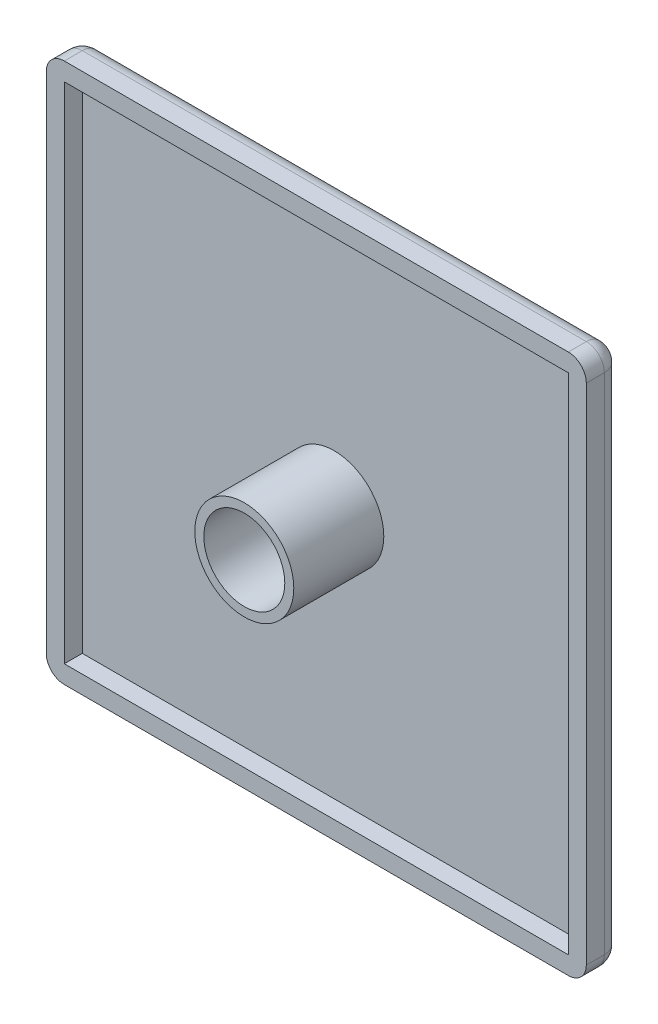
ISO-10303-21;
HEADER;
FILE_DESCRIPTION(('STEP AP214'),'2;1');
FILE_NAME('part.step','',(''),(''),'','','');
FILE_SCHEMA(('AUTOMOTIVE_DESIGN { 1 0 10303 214 1 1 1 1 }'));
ENDSEC;
DATA;
#1=APPLICATION_CONTEXT('core data for automotive mechanical design processes');
#2=APPLICATION_PROTOCOL_DEFINITION('international standard','automotive_design',2000,#1);
#3=PRODUCT_CONTEXT('',#1,'mechanical');
#4=PRODUCT('Part','Part','',(#3));
#5=PRODUCT_RELATED_PRODUCT_CATEGORY('part','',(#4));
#6=PRODUCT_DEFINITION_FORMATION('','',#4);
#7=PRODUCT_DEFINITION_CONTEXT('part definition',#1,'design');
#8=PRODUCT_DEFINITION('design','',#6,#7);
#9=PRODUCT_DEFINITION_SHAPE('','',#8);
#10=(LENGTH_UNIT() NAMED_UNIT(*) SI_UNIT(.MILLI.,.METRE.));
#11=(NAMED_UNIT(*) PLANE_ANGLE_UNIT() SI_UNIT($,.RADIAN.));
#12=(NAMED_UNIT(*) SI_UNIT($,.STERADIAN.) SOLID_ANGLE_UNIT());
#13=UNCERTAINTY_MEASURE_WITH_UNIT(LENGTH_MEASURE(1.E-05),#10,'distance_accuracy_value','');
#14=(GEOMETRIC_REPRESENTATION_CONTEXT(3) GLOBAL_UNCERTAINTY_ASSIGNED_CONTEXT((#13)) GLOBAL_UNIT_ASSIGNED_CONTEXT((#10,
#11,#12)) REPRESENTATION_CONTEXT('',''));
#15=CARTESIAN_POINT('',(0.,0.,0.));
#16=DIRECTION('',(0.,0.,1.));
#17=DIRECTION('',(1.,0.,0.));
#18=AXIS2_PLACEMENT_3D('',#15,#16,#17);
#19=CARTESIAN_POINT('',(0.,0.,0.));
#20=DIRECTION('',(0.,0.,1.));
#21=DIRECTION('',(1.,0.,0.));
#22=AXIS2_PLACEMENT_3D('',#19,#20,#21);
#23=PLANE('',#22);
#24=DIRECTION('',(0.,-1.,0.));
#25=VECTOR('',#24,1.);
#26=CARTESIAN_POINT('',(-28.,30.,0.));
#27=LINE('',#26,#25);
#28=CARTESIAN_POINT('',(-28.,28.,0.));
#29=VERTEX_POINT('',#28);
#30=CARTESIAN_POINT('',(-28.,-28.,0.));
#31=VERTEX_POINT('',#30);
#32=EDGE_CURVE('E140',#29,#31,#27,.T.);
#33=ORIENTED_EDGE('',*,*,#32,.T.);
#34=DIRECTION('',(1.,0.,0.));
#35=VECTOR('',#34,1.);
#36=CARTESIAN_POINT('',(-30.,-28.,0.));
#37=LINE('',#36,#35);
#38=CARTESIAN_POINT('',(28.,-28.,0.));
#39=VERTEX_POINT('',#38);
#40=EDGE_CURVE('E133',#31,#39,#37,.T.);
#41=ORIENTED_EDGE('',*,*,#40,.T.);
#42=DIRECTION('',(0.,1.,0.));
#43=VECTOR('',#42,1.);
#44=CARTESIAN_POINT('',(28.,30.,0.));
#45=LINE('',#44,#43);
#46=CARTESIAN_POINT('',(28.,28.,0.));
#47=VERTEX_POINT('',#46);
#48=EDGE_CURVE('E137',#39,#47,#45,.T.);
#49=ORIENTED_EDGE('',*,*,#48,.T.);
#50=DIRECTION('',(-1.,0.,0.));
#51=VECTOR('',#50,1.);
#52=CARTESIAN_POINT('',(-30.,28.,0.));
#53=LINE('',#52,#51);
#54=EDGE_CURVE('E158',#47,#29,#53,.T.);
#55=ORIENTED_EDGE('',*,*,#54,.T.);
#56=EDGE_LOOP('',(#33,#41,#49,#55));
#57=FACE_BOUND('',#56,.T.);
#58=CARTESIAN_POINT('',(0.,0.,0.));
#59=DIRECTION('',(0.,0.,1.));
#60=DIRECTION('',(1.,0.,0.));
#61=AXIS2_PLACEMENT_3D('',#58,#59,#60);
#62=CIRCLE('',#61,5.5);
#63=CARTESIAN_POINT('',(5.5,0.,0.));
#64=VERTEX_POINT('',#63);
#65=EDGE_CURVE('E260',#64,#64,#62,.T.);
#66=ORIENTED_EDGE('',*,*,#65,.F.);
#67=EDGE_LOOP('',(#66));
#68=FACE_BOUND('',#67,.T.);
#69=ADVANCED_FACE('F33',(#57,#68),#23,.T.);
#70=CARTESIAN_POINT('',(-30.,30.,2.));
#71=DIRECTION('',(1.,0.,0.));
#72=DIRECTION('',(0.,1.,0.));
#73=AXIS2_PLACEMENT_3D('',#70,#71,#72);
#74=PLANE('',#73);
#75=DIRECTION('',(0.,-1.,0.));
#76=VECTOR('',#75,1.);
#77=CARTESIAN_POINT('',(-30.,30.,2.));
#78=LINE('',#77,#76);
#79=CARTESIAN_POINT('',(-30.,28.,2.));
#80=VERTEX_POINT('',#79);
#81=CARTESIAN_POINT('',(-30.,-28.,2.));
#82=VERTEX_POINT('',#81);
#83=EDGE_CURVE('E171',#80,#82,#78,.T.);
#84=ORIENTED_EDGE('',*,*,#83,.F.);
#85=DIRECTION('',(0.,0.,-1.));
#86=VECTOR('',#85,1.);
#87=CARTESIAN_POINT('',(-30.,28.,2.));
#88=LINE('',#87,#86);
#89=CARTESIAN_POINT('',(-30.,28.,0.));
#90=VERTEX_POINT('',#89);
#91=EDGE_CURVE('E187',#80,#90,#88,.T.);
#92=ORIENTED_EDGE('',*,*,#91,.T.);
#93=DIRECTION('',(0.,-1.,0.));
#94=VECTOR('',#93,1.);
#95=CARTESIAN_POINT('',(-30.,30.,0.));
#96=LINE('',#95,#94);
#97=CARTESIAN_POINT('',(-30.,-28.,0.));
#98=VERTEX_POINT('',#97);
#99=EDGE_CURVE('E183',#90,#98,#96,.T.);
#100=ORIENTED_EDGE('',*,*,#99,.T.);
#101=DIRECTION('',(0.,0.,-1.));
#102=VECTOR('',#101,1.);
#103=CARTESIAN_POINT('',(-30.,-28.,2.));
#104=LINE('',#103,#102);
#105=EDGE_CURVE('E185',#98,#82,#104,.F.);
#106=ORIENTED_EDGE('',*,*,#105,.T.);
#107=EDGE_LOOP('',(#84,#92,#100,#106));
#108=FACE_BOUND('',#107,.T.);
#109=ADVANCED_FACE('F290',(#108),#74,.F.);
#110=CARTESIAN_POINT('',(-30.,-30.,2.));
#111=DIRECTION('',(0.,1.,0.));
#112=DIRECTION('',(0.,0.,1.));
#113=AXIS2_PLACEMENT_3D('',#110,#111,#112);
#114=PLANE('',#113);
#115=DIRECTION('',(1.,0.,0.));
#116=VECTOR('',#115,1.);
#117=CARTESIAN_POINT('',(-30.,-30.,0.));
#118=LINE('',#117,#116);
#119=CARTESIAN_POINT('',(-28.,-30.,0.));
#120=VERTEX_POINT('',#119);
#121=CARTESIAN_POINT('',(28.,-30.,0.));
#122=VERTEX_POINT('',#121);
#123=EDGE_CURVE('E210',#120,#122,#118,.T.);
#124=ORIENTED_EDGE('',*,*,#123,.T.);
#125=DIRECTION('',(0.,0.,-1.));
#126=VECTOR('',#125,1.);
#127=CARTESIAN_POINT('',(28.,-30.,2.));
#128=LINE('',#127,#126);
#129=CARTESIAN_POINT('',(28.,-30.,2.));
#130=VERTEX_POINT('',#129);
#131=EDGE_CURVE('E214',#122,#130,#128,.F.);
#132=ORIENTED_EDGE('',*,*,#131,.T.);
#133=DIRECTION('',(1.,0.,0.));
#134=VECTOR('',#133,1.);
#135=CARTESIAN_POINT('',(-30.,-30.,2.));
#136=LINE('',#135,#134);
#137=CARTESIAN_POINT('',(-28.,-30.,2.));
#138=VERTEX_POINT('',#137);
#139=EDGE_CURVE('E174',#138,#130,#136,.T.);
#140=ORIENTED_EDGE('',*,*,#139,.F.);
#141=DIRECTION('',(0.,0.,-1.));
#142=VECTOR('',#141,1.);
#143=CARTESIAN_POINT('',(-28.,-30.,2.));
#144=LINE('',#143,#142);
#145=EDGE_CURVE('E212',#138,#120,#144,.T.);
#146=ORIENTED_EDGE('',*,*,#145,.T.);
#147=EDGE_LOOP('',(#124,#132,#140,#146));
#148=FACE_BOUND('',#147,.T.);
#149=ADVANCED_FACE('F301',(#148),#114,.F.);
#150=CARTESIAN_POINT('',(30.,30.,2.));
#151=DIRECTION('',(-1.,0.,0.));
#152=DIRECTION('',(0.,0.,1.));
#153=AXIS2_PLACEMENT_3D('',#150,#151,#152);
#154=PLANE('',#153);
#155=DIRECTION('',(0.,1.,0.));
#156=VECTOR('',#155,1.);
#157=CARTESIAN_POINT('',(30.,30.,2.));
#158=LINE('',#157,#156);
#159=CARTESIAN_POINT('',(30.,-28.,2.));
#160=VERTEX_POINT('',#159);
#161=CARTESIAN_POINT('',(30.,28.,2.));
#162=VERTEX_POINT('',#161);
#163=EDGE_CURVE('E177',#160,#162,#158,.T.);
#164=ORIENTED_EDGE('',*,*,#163,.F.);
#165=DIRECTION('',(0.,0.,-1.));
#166=VECTOR('',#165,1.);
#167=CARTESIAN_POINT('',(30.,-28.,2.));
#168=LINE('',#167,#166);
#169=CARTESIAN_POINT('',(30.,-28.,0.));
#170=VERTEX_POINT('',#169);
#171=EDGE_CURVE('E208',#160,#170,#168,.T.);
#172=ORIENTED_EDGE('',*,*,#171,.T.);
#173=DIRECTION('',(0.,1.,0.));
#174=VECTOR('',#173,1.);
#175=CARTESIAN_POINT('',(30.,30.,0.));
#176=LINE('',#175,#174);
#177=CARTESIAN_POINT('',(30.,28.,0.));
#178=VERTEX_POINT('',#177);
#179=EDGE_CURVE('E206',#170,#178,#176,.T.);
#180=ORIENTED_EDGE('',*,*,#179,.T.);
#181=DIRECTION('',(0.,0.,-1.));
#182=VECTOR('',#181,1.);
#183=CARTESIAN_POINT('',(30.,28.,2.));
#184=LINE('',#183,#182);
#185=EDGE_CURVE('E204',#178,#162,#184,.F.);
#186=ORIENTED_EDGE('',*,*,#185,.T.);
#187=EDGE_LOOP('',(#164,#172,#180,#186));
#188=FACE_BOUND('',#187,.T.);
#189=ADVANCED_FACE('F314',(#188),#154,.F.);
#190=CARTESIAN_POINT('',(-30.,30.,2.));
#191=DIRECTION('',(0.,-1.,0.));
#192=DIRECTION('',(1.,0.,0.));
#193=AXIS2_PLACEMENT_3D('',#190,#191,#192);
#194=PLANE('',#193);
#195=DIRECTION('',(-1.,0.,0.));
#196=VECTOR('',#195,1.);
#197=CARTESIAN_POINT('',(-30.,30.,0.));
#198=LINE('',#197,#196);
#199=CARTESIAN_POINT('',(28.,30.,0.));
#200=VERTEX_POINT('',#199);
#201=CARTESIAN_POINT('',(-28.,30.,0.));
#202=VERTEX_POINT('',#201);
#203=EDGE_CURVE('E192',#200,#202,#198,.T.);
#204=ORIENTED_EDGE('',*,*,#203,.T.);
#205=DIRECTION('',(0.,0.,-1.));
#206=VECTOR('',#205,1.);
#207=CARTESIAN_POINT('',(-28.,30.,2.));
#208=LINE('',#207,#206);
#209=CARTESIAN_POINT('',(-28.,30.,2.));
#210=VERTEX_POINT('',#209);
#211=EDGE_CURVE('E194',#202,#210,#208,.F.);
#212=ORIENTED_EDGE('',*,*,#211,.T.);
#213=DIRECTION('',(-1.,0.,0.));
#214=VECTOR('',#213,1.);
#215=CARTESIAN_POINT('',(-30.,30.,2.));
#216=LINE('',#215,#214);
#217=CARTESIAN_POINT('',(28.,30.,2.));
#218=VERTEX_POINT('',#217);
#219=EDGE_CURVE('E180',#218,#210,#216,.T.);
#220=ORIENTED_EDGE('',*,*,#219,.F.);
#221=DIRECTION('',(0.,0.,-1.));
#222=VECTOR('',#221,1.);
#223=CARTESIAN_POINT('',(28.,30.,2.));
#224=LINE('',#223,#222);
#225=EDGE_CURVE('E190',#218,#200,#224,.T.);
#226=ORIENTED_EDGE('',*,*,#225,.T.);
#227=EDGE_LOOP('',(#204,#212,#220,#226));
#228=FACE_BOUND('',#227,.T.);
#229=ADVANCED_FACE('F276',(#228),#194,.F.);
#230=CARTESIAN_POINT('',(0.,0.,2.));
#231=DIRECTION('',(0.,0.,1.));
#232=DIRECTION('',(1.,0.,0.));
#233=AXIS2_PLACEMENT_3D('',#230,#231,#232);
#234=PLANE('',#233);
#235=DIRECTION('',(0.,-1.,0.));
#236=VECTOR('',#235,1.);
#237=CARTESIAN_POINT('',(-28.,30.,2.));
#238=LINE('',#237,#236);
#239=CARTESIAN_POINT('',(-28.,28.,2.));
#240=VERTEX_POINT('',#239);
#241=CARTESIAN_POINT('',(-28.,-28.,2.));
#242=VERTEX_POINT('',#241);
#243=EDGE_CURVE('E160',#240,#242,#238,.T.);
#244=ORIENTED_EDGE('',*,*,#243,.F.);
#245=DIRECTION('',(-1.,0.,0.));
#246=VECTOR('',#245,1.);
#247=CARTESIAN_POINT('',(-30.,28.,2.));
#248=LINE('',#247,#246);
#249=CARTESIAN_POINT('',(28.,28.,2.));
#250=VERTEX_POINT('',#249);
#251=EDGE_CURVE('E169',#250,#240,#248,.T.);
#252=ORIENTED_EDGE('',*,*,#251,.F.);
#253=DIRECTION('',(0.,1.,0.));
#254=VECTOR('',#253,1.);
#255=CARTESIAN_POINT('',(28.,30.,2.));
#256=LINE('',#255,#254);
#257=CARTESIAN_POINT('',(28.,-28.,2.));
#258=VERTEX_POINT('',#257);
#259=EDGE_CURVE('E167',#258,#250,#256,.T.);
#260=ORIENTED_EDGE('',*,*,#259,.F.);
#261=DIRECTION('',(1.,0.,0.));
#262=VECTOR('',#261,1.);
#263=CARTESIAN_POINT('',(-30.,-28.,2.));
#264=LINE('',#263,#262);
#265=EDGE_CURVE('E149',#242,#258,#264,.T.);
#266=ORIENTED_EDGE('',*,*,#265,.F.);
#267=EDGE_LOOP('',(#244,#252,#260,#266));
#268=FACE_BOUND('',#267,.T.);
#269=ORIENTED_EDGE('',*,*,#219,.T.);
#270=CARTESIAN_POINT('',(-28.,28.,2.));
#271=DIRECTION('',(0.,0.,1.));
#272=DIRECTION('',(1.,0.,0.));
#273=AXIS2_PLACEMENT_3D('',#270,#271,#272);
#274=CIRCLE('',#273,2.);
#275=EDGE_CURVE('E202',#210,#80,#274,.T.);
#276=ORIENTED_EDGE('',*,*,#275,.T.);
#277=ORIENTED_EDGE('',*,*,#83,.T.);
#278=CARTESIAN_POINT('',(-28.,-28.,2.));
#279=DIRECTION('',(0.,0.,1.));
#280=DIRECTION('',(1.,0.,0.));
#281=AXIS2_PLACEMENT_3D('',#278,#279,#280);
#282=CIRCLE('',#281,2.);
#283=EDGE_CURVE('E198',#82,#138,#282,.T.);
#284=ORIENTED_EDGE('',*,*,#283,.T.);
#285=ORIENTED_EDGE('',*,*,#139,.T.);
#286=CARTESIAN_POINT('',(28.,-28.,2.));
#287=DIRECTION('',(0.,0.,1.));
#288=DIRECTION('',(1.,0.,0.));
#289=AXIS2_PLACEMENT_3D('',#286,#287,#288);
#290=CIRCLE('',#289,2.);
#291=EDGE_CURVE('E200',#130,#160,#290,.T.);
#292=ORIENTED_EDGE('',*,*,#291,.T.);
#293=ORIENTED_EDGE('',*,*,#163,.T.);
#294=CARTESIAN_POINT('',(28.,28.,2.));
#295=DIRECTION('',(0.,0.,1.));
#296=DIRECTION('',(1.,0.,0.));
#297=AXIS2_PLACEMENT_3D('',#294,#295,#296);
#298=CIRCLE('',#297,2.);
#299=EDGE_CURVE('E196',#162,#218,#298,.T.);
#300=ORIENTED_EDGE('',*,*,#299,.T.);
#301=EDGE_LOOP('',(#269,#276,#277,#284,#285,#292,#293,#300));
#302=FACE_BOUND('',#301,.T.);
#303=ADVANCED_FACE('F272',(#268,#302),#234,.T.);
#304=CARTESIAN_POINT('',(0.,0.,-2.));
#305=DIRECTION('',(0.,0.,1.));
#306=DIRECTION('',(1.,0.,0.));
#307=AXIS2_PLACEMENT_3D('',#304,#305,#306);
#308=PLANE('',#307);
#309=DIRECTION('',(1.,0.,0.));
#310=VECTOR('',#309,1.);
#311=CARTESIAN_POINT('',(0.,-28.,-2.));
#312=LINE('',#311,#310);
#313=CARTESIAN_POINT('',(28.,-28.,-2.));
#314=VERTEX_POINT('',#313);
#315=CARTESIAN_POINT('',(-28.,-28.,-2.));
#316=VERTEX_POINT('',#315);
#317=EDGE_CURVE('E48',#314,#316,#312,.F.);
#318=ORIENTED_EDGE('',*,*,#317,.T.);
#319=DIRECTION('',(0.,-1.,0.));
#320=VECTOR('',#319,1.);
#321=CARTESIAN_POINT('',(-28.,0.,-2.));
#322=LINE('',#321,#320);
#323=CARTESIAN_POINT('',(-28.,28.,-2.));
#324=VERTEX_POINT('',#323);
#325=EDGE_CURVE('E41',#316,#324,#322,.F.);
#326=ORIENTED_EDGE('',*,*,#325,.T.);
#327=DIRECTION('',(-1.,0.,0.));
#328=VECTOR('',#327,1.);
#329=CARTESIAN_POINT('',(0.,28.,-2.));
#330=LINE('',#329,#328);
#331=CARTESIAN_POINT('',(28.,28.,-2.));
#332=VERTEX_POINT('',#331);
#333=EDGE_CURVE('E216',#324,#332,#330,.F.);
#334=ORIENTED_EDGE('',*,*,#333,.T.);
#335=DIRECTION('',(0.,1.,0.));
#336=VECTOR('',#335,1.);
#337=CARTESIAN_POINT('',(28.,0.,-2.));
#338=LINE('',#337,#336);
#339=EDGE_CURVE('E53',#332,#314,#338,.F.);
#340=ORIENTED_EDGE('',*,*,#339,.T.);
#341=EDGE_LOOP('',(#318,#326,#334,#340));
#342=FACE_BOUND('',#341,.T.);
#343=ADVANCED_FACE('F275',(#342),#308,.F.);
#344=CARTESIAN_POINT('',(-28.,30.,2.));
#345=DIRECTION('',(1.,0.,0.));
#346=DIRECTION('',(0.,1.,0.));
#347=AXIS2_PLACEMENT_3D('',#344,#345,#346);
#348=PLANE('',#347);
#349=ORIENTED_EDGE('',*,*,#32,.F.);
#350=DIRECTION('',(0.,0.,-1.));
#351=VECTOR('',#350,1.);
#352=CARTESIAN_POINT('',(-28.,28.,2.));
#353=LINE('',#352,#351);
#354=EDGE_CURVE('E163',#240,#29,#353,.T.);
#355=ORIENTED_EDGE('',*,*,#354,.F.);
#356=ORIENTED_EDGE('',*,*,#243,.T.);
#357=DIRECTION('',(0.,0.,-1.));
#358=VECTOR('',#357,1.);
#359=CARTESIAN_POINT('',(-28.,-28.,2.));
#360=LINE('',#359,#358);
#361=EDGE_CURVE('E153',#242,#31,#360,.T.);
#362=ORIENTED_EDGE('',*,*,#361,.T.);
#363=EDGE_LOOP('',(#349,#355,#356,#362));
#364=FACE_BOUND('',#363,.T.);
#365=ADVANCED_FACE('F270',(#364),#348,.T.);
#366=CARTESIAN_POINT('',(-30.,-28.,2.));
#367=DIRECTION('',(0.,1.,0.));
#368=DIRECTION('',(0.,0.,1.));
#369=AXIS2_PLACEMENT_3D('',#366,#367,#368);
#370=PLANE('',#369);
#371=ORIENTED_EDGE('',*,*,#40,.F.);
#372=ORIENTED_EDGE('',*,*,#361,.F.);
#373=ORIENTED_EDGE('',*,*,#265,.T.);
#374=DIRECTION('',(0.,0.,-1.));
#375=VECTOR('',#374,1.);
#376=CARTESIAN_POINT('',(28.,-28.,2.));
#377=LINE('',#376,#375);
#378=EDGE_CURVE('E146',#258,#39,#377,.T.);
#379=ORIENTED_EDGE('',*,*,#378,.T.);
#380=EDGE_LOOP('',(#371,#372,#373,#379));
#381=FACE_BOUND('',#380,.T.);
#382=ADVANCED_FACE('F147',(#381),#370,.T.);
#383=CARTESIAN_POINT('',(28.,30.,2.));
#384=DIRECTION('',(-1.,0.,0.));
#385=DIRECTION('',(0.,0.,1.));
#386=AXIS2_PLACEMENT_3D('',#383,#384,#385);
#387=PLANE('',#386);
#388=ORIENTED_EDGE('',*,*,#48,.F.);
#389=ORIENTED_EDGE('',*,*,#378,.F.);
#390=ORIENTED_EDGE('',*,*,#259,.T.);
#391=DIRECTION('',(0.,0.,-1.));
#392=VECTOR('',#391,1.);
#393=CARTESIAN_POINT('',(28.,28.,2.));
#394=LINE('',#393,#392);
#395=EDGE_CURVE('E154',#250,#47,#394,.T.);
#396=ORIENTED_EDGE('',*,*,#395,.T.);
#397=EDGE_LOOP('',(#388,#389,#390,#396));
#398=FACE_BOUND('',#397,.T.);
#399=ADVANCED_FACE('F156',(#398),#387,.T.);
#400=CARTESIAN_POINT('',(-30.,28.,2.));
#401=DIRECTION('',(0.,-1.,0.));
#402=DIRECTION('',(1.,0.,0.));
#403=AXIS2_PLACEMENT_3D('',#400,#401,#402);
#404=PLANE('',#403);
#405=ORIENTED_EDGE('',*,*,#54,.F.);
#406=ORIENTED_EDGE('',*,*,#395,.F.);
#407=ORIENTED_EDGE('',*,*,#251,.T.);
#408=ORIENTED_EDGE('',*,*,#354,.T.);
#409=EDGE_LOOP('',(#405,#406,#407,#408));
#410=FACE_BOUND('',#409,.T.);
#411=ADVANCED_FACE('F266',(#410),#404,.T.);
#412=CARTESIAN_POINT('',(28.,-28.,2.));
#413=DIRECTION('',(0.,0.,-1.));
#414=DIRECTION('',(-1.,0.,0.));
#415=AXIS2_PLACEMENT_3D('',#412,#413,#414);
#416=CYLINDRICAL_SURFACE('',#415,2.);
#417=CARTESIAN_POINT('',(28.,-28.,0.));
#418=DIRECTION('',(0.,0.,-1.));
#419=DIRECTION('',(-1.,0.,0.));
#420=AXIS2_PLACEMENT_3D('',#417,#418,#419);
#421=CIRCLE('',#420,2.);
#422=EDGE_CURVE('E251',#170,#122,#421,.T.);
#423=ORIENTED_EDGE('',*,*,#422,.F.);
#424=ORIENTED_EDGE('',*,*,#171,.F.);
#425=ORIENTED_EDGE('',*,*,#291,.F.);
#426=ORIENTED_EDGE('',*,*,#131,.F.);
#427=EDGE_LOOP('',(#423,#424,#425,#426));
#428=FACE_BOUND('',#427,.T.);
#429=ADVANCED_FACE('F35',(#428),#416,.T.);
#430=CARTESIAN_POINT('',(28.,-28.,0.));
#431=DIRECTION('',(0.,0.,1.));
#432=DIRECTION('',(1.,0.,0.));
#433=AXIS2_PLACEMENT_3D('',#430,#431,#432);
#434=SPHERICAL_SURFACE('',#433,2.);
#435=CARTESIAN_POINT('',(28.,-28.,0.));
#436=DIRECTION('',(0.,-1.,0.));
#437=DIRECTION('',(1.,0.,0.));
#438=AXIS2_PLACEMENT_3D('',#435,#436,#437);
#439=CIRCLE('',#438,2.);
#440=EDGE_CURVE('E247',#170,#314,#439,.F.);
#441=ORIENTED_EDGE('',*,*,#440,.F.);
#442=ORIENTED_EDGE('',*,*,#422,.T.);
#443=CARTESIAN_POINT('',(28.,-28.,0.));
#444=DIRECTION('',(1.,0.,0.));
#445=DIRECTION('',(0.,0.,-1.));
#446=AXIS2_PLACEMENT_3D('',#443,#444,#445);
#447=CIRCLE('',#446,2.);
#448=EDGE_CURVE('E249',#314,#122,#447,.F.);
#449=ORIENTED_EDGE('',*,*,#448,.F.);
#450=EDGE_LOOP('',(#441,#442,#449));
#451=FACE_BOUND('',#450,.T.);
#452=ADVANCED_FACE('F306',(#451),#434,.T.);
#453=CARTESIAN_POINT('',(-28.,-28.,2.));
#454=DIRECTION('',(0.,0.,-1.));
#455=DIRECTION('',(-1.,0.,0.));
#456=AXIS2_PLACEMENT_3D('',#453,#454,#455);
#457=CYLINDRICAL_SURFACE('',#456,2.);
#458=ORIENTED_EDGE('',*,*,#283,.F.);
#459=ORIENTED_EDGE('',*,*,#105,.F.);
#460=CARTESIAN_POINT('',(-28.,-28.,0.));
#461=DIRECTION('',(0.,0.,-1.));
#462=DIRECTION('',(-1.,0.,0.));
#463=AXIS2_PLACEMENT_3D('',#460,#461,#462);
#464=CIRCLE('',#463,2.);
#465=EDGE_CURVE('E244',#120,#98,#464,.T.);
#466=ORIENTED_EDGE('',*,*,#465,.F.);
#467=ORIENTED_EDGE('',*,*,#145,.F.);
#468=EDGE_LOOP('',(#458,#459,#466,#467));
#469=FACE_BOUND('',#468,.T.);
#470=ADVANCED_FACE('F297',(#469),#457,.T.);
#471=CARTESIAN_POINT('',(-30.,-28.,0.));
#472=DIRECTION('',(1.,0.,0.));
#473=DIRECTION('',(0.,0.,-1.));
#474=AXIS2_PLACEMENT_3D('',#471,#472,#473);
#475=CYLINDRICAL_SURFACE('',#474,2.);
#476=ORIENTED_EDGE('',*,*,#448,.T.);
#477=ORIENTED_EDGE('',*,*,#123,.F.);
#478=CARTESIAN_POINT('',(-28.,-28.,0.));
#479=DIRECTION('',(-1.,0.,0.));
#480=DIRECTION('',(0.,0.,1.));
#481=AXIS2_PLACEMENT_3D('',#478,#479,#480);
#482=CIRCLE('',#481,2.);
#483=EDGE_CURVE('E241',#316,#120,#482,.T.);
#484=ORIENTED_EDGE('',*,*,#483,.F.);
#485=ORIENTED_EDGE('',*,*,#317,.F.);
#486=EDGE_LOOP('',(#476,#477,#484,#485));
#487=FACE_BOUND('',#486,.T.);
#488=ADVANCED_FACE('F304',(#487),#475,.T.);
#489=CARTESIAN_POINT('',(28.,30.,0.));
#490=DIRECTION('',(0.,1.,0.));
#491=DIRECTION('',(0.,0.,1.));
#492=AXIS2_PLACEMENT_3D('',#489,#490,#491);
#493=CYLINDRICAL_SURFACE('',#492,2.);
#494=ORIENTED_EDGE('',*,*,#440,.T.);
#495=ORIENTED_EDGE('',*,*,#339,.F.);
#496=CARTESIAN_POINT('',(28.,28.,0.));
#497=DIRECTION('',(0.,1.,0.));
#498=DIRECTION('',(0.,0.,1.));
#499=AXIS2_PLACEMENT_3D('',#496,#497,#498);
#500=CIRCLE('',#499,2.);
#501=EDGE_CURVE('E238',#178,#332,#500,.T.);
#502=ORIENTED_EDGE('',*,*,#501,.F.);
#503=ORIENTED_EDGE('',*,*,#179,.F.);
#504=EDGE_LOOP('',(#494,#495,#502,#503));
#505=FACE_BOUND('',#504,.T.);
#506=ADVANCED_FACE('F310',(#505),#493,.T.);
#507=CARTESIAN_POINT('',(28.,28.,2.));
#508=DIRECTION('',(0.,0.,-1.));
#509=DIRECTION('',(-1.,0.,0.));
#510=AXIS2_PLACEMENT_3D('',#507,#508,#509);
#511=CYLINDRICAL_SURFACE('',#510,2.);
#512=ORIENTED_EDGE('',*,*,#299,.F.);
#513=ORIENTED_EDGE('',*,*,#185,.F.);
#514=CARTESIAN_POINT('',(28.,28.,0.));
#515=DIRECTION('',(0.,0.,-1.));
#516=DIRECTION('',(-1.,0.,0.));
#517=AXIS2_PLACEMENT_3D('',#514,#515,#516);
#518=CIRCLE('',#517,2.);
#519=EDGE_CURVE('E235',#200,#178,#518,.T.);
#520=ORIENTED_EDGE('',*,*,#519,.F.);
#521=ORIENTED_EDGE('',*,*,#225,.F.);
#522=EDGE_LOOP('',(#512,#513,#520,#521));
#523=FACE_BOUND('',#522,.T.);
#524=ADVANCED_FACE('F318',(#523),#511,.T.);
#525=CARTESIAN_POINT('',(-28.,-28.,0.));
#526=DIRECTION('',(0.,0.,1.));
#527=DIRECTION('',(1.,0.,0.));
#528=AXIS2_PLACEMENT_3D('',#525,#526,#527);
#529=SPHERICAL_SURFACE('',#528,2.);
#530=ORIENTED_EDGE('',*,*,#483,.T.);
#531=ORIENTED_EDGE('',*,*,#465,.T.);
#532=CARTESIAN_POINT('',(-28.,-28.,0.));
#533=DIRECTION('',(0.,-1.,0.));
#534=DIRECTION('',(0.,0.,-1.));
#535=AXIS2_PLACEMENT_3D('',#532,#533,#534);
#536=CIRCLE('',#535,2.);
#537=EDGE_CURVE('E232',#316,#98,#536,.F.);
#538=ORIENTED_EDGE('',*,*,#537,.F.);
#539=EDGE_LOOP('',(#530,#531,#538));
#540=FACE_BOUND('',#539,.T.);
#541=ADVANCED_FACE('F332',(#540),#529,.T.);
#542=CARTESIAN_POINT('',(28.,28.,0.));
#543=DIRECTION('',(0.,0.,1.));
#544=DIRECTION('',(1.,0.,0.));
#545=AXIS2_PLACEMENT_3D('',#542,#543,#544);
#546=SPHERICAL_SURFACE('',#545,2.);
#547=ORIENTED_EDGE('',*,*,#519,.T.);
#548=ORIENTED_EDGE('',*,*,#501,.T.);
#549=CARTESIAN_POINT('',(28.,28.,0.));
#550=DIRECTION('',(1.,0.,0.));
#551=DIRECTION('',(0.,1.,0.));
#552=AXIS2_PLACEMENT_3D('',#549,#550,#551);
#553=CIRCLE('',#552,2.);
#554=EDGE_CURVE('E229',#200,#332,#553,.F.);
#555=ORIENTED_EDGE('',*,*,#554,.F.);
#556=EDGE_LOOP('',(#547,#548,#555));
#557=FACE_BOUND('',#556,.T.);
#558=ADVANCED_FACE('F334',(#557),#546,.T.);
#559=CARTESIAN_POINT('',(-28.,30.,0.));
#560=DIRECTION('',(0.,-1.,0.));
#561=DIRECTION('',(1.,0.,0.));
#562=AXIS2_PLACEMENT_3D('',#559,#560,#561);
#563=CYLINDRICAL_SURFACE('',#562,2.);
#564=ORIENTED_EDGE('',*,*,#537,.T.);
#565=ORIENTED_EDGE('',*,*,#99,.F.);
#566=CARTESIAN_POINT('',(-28.,28.,0.));
#567=DIRECTION('',(0.,1.,0.));
#568=DIRECTION('',(0.,0.,1.));
#569=AXIS2_PLACEMENT_3D('',#566,#567,#568);
#570=CIRCLE('',#569,2.);
#571=EDGE_CURVE('E226',#324,#90,#570,.T.);
#572=ORIENTED_EDGE('',*,*,#571,.F.);
#573=ORIENTED_EDGE('',*,*,#325,.F.);
#574=EDGE_LOOP('',(#564,#565,#572,#573));
#575=FACE_BOUND('',#574,.T.);
#576=ADVANCED_FACE('F330',(#575),#563,.T.);
#577=CARTESIAN_POINT('',(-30.,28.,0.));
#578=DIRECTION('',(-1.,0.,0.));
#579=DIRECTION('',(0.,-1.,0.));
#580=AXIS2_PLACEMENT_3D('',#577,#578,#579);
#581=CYLINDRICAL_SURFACE('',#580,2.);
#582=ORIENTED_EDGE('',*,*,#554,.T.);
#583=ORIENTED_EDGE('',*,*,#333,.F.);
#584=CARTESIAN_POINT('',(-28.,28.,0.));
#585=DIRECTION('',(-1.,0.,0.));
#586=DIRECTION('',(0.,0.,1.));
#587=AXIS2_PLACEMENT_3D('',#584,#585,#586);
#588=CIRCLE('',#587,2.);
#589=EDGE_CURVE('E223',#202,#324,#588,.T.);
#590=ORIENTED_EDGE('',*,*,#589,.F.);
#591=ORIENTED_EDGE('',*,*,#203,.F.);
#592=EDGE_LOOP('',(#582,#583,#590,#591));
#593=FACE_BOUND('',#592,.T.);
#594=ADVANCED_FACE('F324',(#593),#581,.T.);
#595=CARTESIAN_POINT('',(-28.,28.,0.));
#596=DIRECTION('',(0.,0.,1.));
#597=DIRECTION('',(1.,0.,0.));
#598=AXIS2_PLACEMENT_3D('',#595,#596,#597);
#599=SPHERICAL_SURFACE('',#598,2.);
#600=ORIENTED_EDGE('',*,*,#589,.T.);
#601=ORIENTED_EDGE('',*,*,#571,.T.);
#602=CARTESIAN_POINT('',(-28.,28.,0.));
#603=DIRECTION('',(0.,0.,-1.));
#604=DIRECTION('',(-1.,0.,0.));
#605=AXIS2_PLACEMENT_3D('',#602,#603,#604);
#606=CIRCLE('',#605,2.);
#607=EDGE_CURVE('E221',#202,#90,#606,.F.);
#608=ORIENTED_EDGE('',*,*,#607,.F.);
#609=EDGE_LOOP('',(#600,#601,#608));
#610=FACE_BOUND('',#609,.T.);
#611=ADVANCED_FACE('F327',(#610),#599,.T.);
#612=CARTESIAN_POINT('',(-28.,28.,2.));
#613=DIRECTION('',(0.,0.,-1.));
#614=DIRECTION('',(-1.,0.,0.));
#615=AXIS2_PLACEMENT_3D('',#612,#613,#614);
#616=CYLINDRICAL_SURFACE('',#615,2.);
#617=ORIENTED_EDGE('',*,*,#275,.F.);
#618=ORIENTED_EDGE('',*,*,#211,.F.);
#619=ORIENTED_EDGE('',*,*,#607,.T.);
#620=ORIENTED_EDGE('',*,*,#91,.F.);
#621=EDGE_LOOP('',(#617,#618,#619,#620));
#622=FACE_BOUND('',#621,.T.);
#623=ADVANCED_FACE('F287',(#622),#616,.T.);
#624=CARTESIAN_POINT('',(0.,0.,10.));
#625=DIRECTION('',(0.,0.,1.));
#626=DIRECTION('',(1.,0.,0.));
#627=AXIS2_PLACEMENT_3D('',#624,#625,#626);
#628=PLANE('',#627);
#629=CARTESIAN_POINT('',(0.,0.,10.));
#630=DIRECTION('',(0.,0.,1.));
#631=DIRECTION('',(1.,0.,0.));
#632=AXIS2_PLACEMENT_3D('',#629,#630,#631);
#633=CIRCLE('',#632,5.5);
#634=CARTESIAN_POINT('',(5.5,0.,10.));
#635=VERTEX_POINT('',#634);
#636=EDGE_CURVE('E224',#635,#635,#633,.T.);
#637=ORIENTED_EDGE('',*,*,#636,.T.);
#638=EDGE_LOOP('',(#637));
#639=FACE_BOUND('',#638,.T.);
#640=CARTESIAN_POINT('',(0.,0.,10.));
#641=DIRECTION('',(0.,0.,1.));
#642=DIRECTION('',(1.,0.,0.));
#643=AXIS2_PLACEMENT_3D('',#640,#641,#642);
#644=CIRCLE('',#643,4.5);
#645=CARTESIAN_POINT('',(4.5,0.,10.));
#646=VERTEX_POINT('',#645);
#647=EDGE_CURVE('E563',#646,#646,#644,.T.);
#648=ORIENTED_EDGE('',*,*,#647,.F.);
#649=EDGE_LOOP('',(#648));
#650=FACE_BOUND('',#649,.T.);
#651=ADVANCED_FACE('F365',(#639,#650),#628,.T.);
#652=CARTESIAN_POINT('',(0.,0.,10.));
#653=DIRECTION('',(0.,0.,-1.));
#654=DIRECTION('',(-1.,0.,0.));
#655=AXIS2_PLACEMENT_3D('',#652,#653,#654);
#656=CYLINDRICAL_SURFACE('',#655,5.5);
#657=ORIENTED_EDGE('',*,*,#636,.F.);
#658=EDGE_LOOP('',(#657));
#659=FACE_BOUND('',#658,.T.);
#660=ORIENTED_EDGE('',*,*,#65,.T.);
#661=EDGE_LOOP('',(#660));
#662=FACE_BOUND('',#661,.T.);
#663=ADVANCED_FACE('F357',(#659,#662),#656,.T.);
#664=CARTESIAN_POINT('',(0.,0.,10.));
#665=DIRECTION('',(0.,0.,-1.));
#666=DIRECTION('',(-1.,0.,0.));
#667=AXIS2_PLACEMENT_3D('',#664,#665,#666);
#668=CYLINDRICAL_SURFACE('',#667,4.5);
#669=ORIENTED_EDGE('',*,*,#647,.T.);
#670=EDGE_LOOP('',(#669));
#671=FACE_BOUND('',#670,.T.);
#672=CARTESIAN_POINT('',(0.,0.,0.));
#673=DIRECTION('',(0.,0.,1.));
#674=DIRECTION('',(1.,0.,0.));
#675=AXIS2_PLACEMENT_3D('',#672,#673,#674);
#676=CIRCLE('',#675,4.5);
#677=CARTESIAN_POINT('',(4.5,0.,0.));
#678=VERTEX_POINT('',#677);
#679=EDGE_CURVE('E11',#678,#678,#676,.F.);
#680=ORIENTED_EDGE('',*,*,#679,.T.);
#681=EDGE_LOOP('',(#680));
#682=FACE_BOUND('',#681,.T.);
#683=ADVANCED_FACE('F352',(#671,#682),#668,.F.);
#684=ORIENTED_EDGE('',*,*,#679,.F.);
#685=EDGE_LOOP('',(#684));
#686=FACE_BOUND('',#685,.T.);
#687=ADVANCED_FACE('F345',(#686),#23,.T.);
#688=CLOSED_SHELL('',(#69,#109,#149,#189,#229,#303,#343,#365,#382,#399,#411,#429,#452,#470,#488,
#506,#524,#541,#558,#576,#594,#611,#623,#651,#663,#683,#687));
#689=MANIFOLD_SOLID_BREP('B2',#688);
#690=ADVANCED_BREP_SHAPE_REPRESENTATION('',(#18,#689),#14);
#691=SHAPE_DEFINITION_REPRESENTATION(#9,#690);
ENDSEC;
END-ISO-10303-21;
